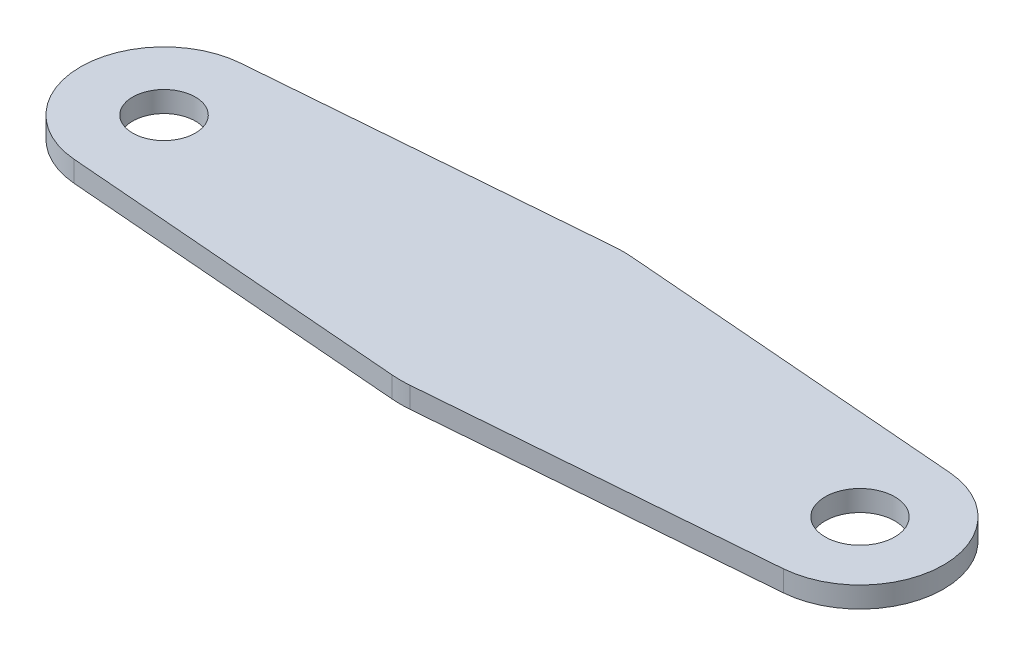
from build123d import *

# Parameters (mm, degrees)
SKETCH1_R      = 2.5
SKETCH1_R_2    = 2.25
EXTRUDE1_DEPTH = 1.5


with BuildPart() as part:
    # Sketch1 → Extrude1 (new body)
    with BuildSketch(Plane(origin=(0, 0, 0), x_dir=(1, 0, 0), z_dir=(0, 1, 0))):
        with BuildLine():
            Line((-25.48, 5.980769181), (-0.64, 7.974358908))
            ThreePointArc((-0.64, 7.974358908), (0, 8), (0.64, 7.974358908))
            Line((0.64, 7.974358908), (25.48, 5.980769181))
            ThreePointArc((25.48, 5.980769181), (31, 0), (25.48, -5.980769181))
            Line((25.48, -5.980769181), (0.64, -7.974358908))
            ThreePointArc((0.64, -7.974358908), (0, -8), (-0.64, -7.974358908))
            Line((-0.64, -7.974358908), (-25.48, -5.980769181))
            ThreePointArc((-25.48, -5.980769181), (-31, 0), (-25.48, 5.980769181))
        make_face()
        with Locations(Location((25, 0, 0), (0, 0, 270))):
            Circle(SKETCH1_R, mode=Mode.SUBTRACT)
        with Locations(Location((-25, 0, 0), (0, 0, 270))):
            Circle(SKETCH1_R_2, mode=Mode.SUBTRACT)
    extrude(amount=EXTRUDE1_DEPTH)


solid = part.part
